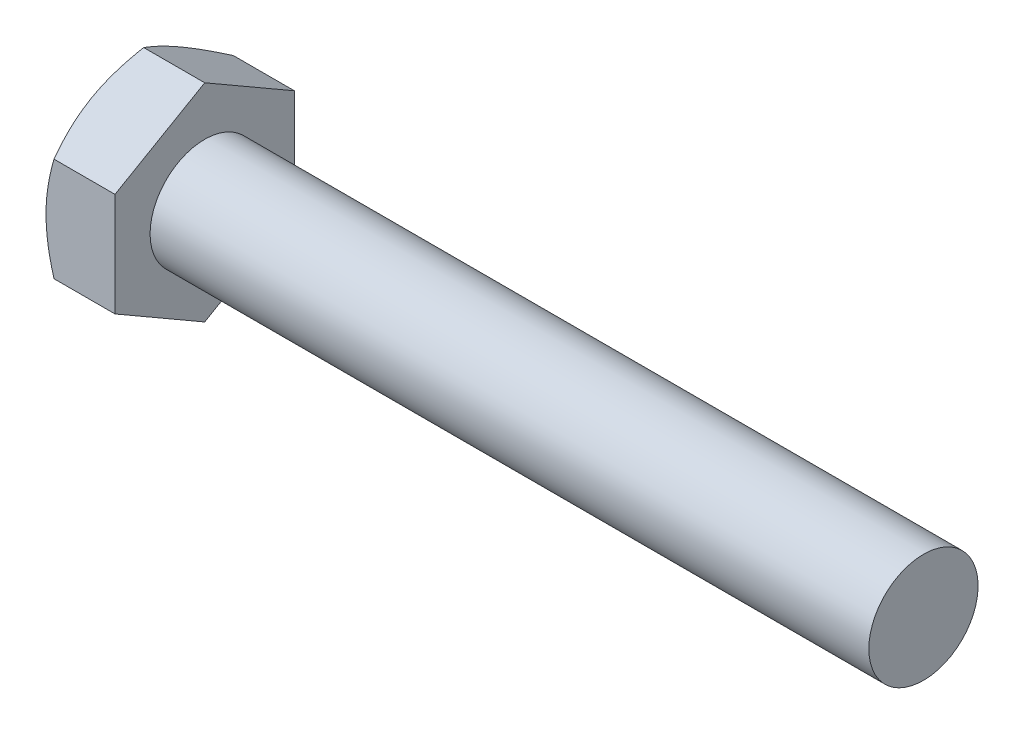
ISO-10303-21;
HEADER;
FILE_DESCRIPTION(('STEP AP214'),'2;1');
FILE_NAME('part.step','',(''),(''),'','','');
FILE_SCHEMA(('AUTOMOTIVE_DESIGN { 1 0 10303 214 1 1 1 1 }'));
ENDSEC;
DATA;
#1=APPLICATION_CONTEXT('core data for automotive mechanical design processes');
#2=APPLICATION_PROTOCOL_DEFINITION('international standard','automotive_design',2000,#1);
#3=PRODUCT_CONTEXT('',#1,'mechanical');
#4=PRODUCT('Part','Part','',(#3));
#5=PRODUCT_RELATED_PRODUCT_CATEGORY('part','',(#4));
#6=PRODUCT_DEFINITION_FORMATION('','',#4);
#7=PRODUCT_DEFINITION_CONTEXT('part definition',#1,'design');
#8=PRODUCT_DEFINITION('design','',#6,#7);
#9=PRODUCT_DEFINITION_SHAPE('','',#8);
#10=(LENGTH_UNIT() NAMED_UNIT(*) SI_UNIT(.MILLI.,.METRE.));
#11=(NAMED_UNIT(*) PLANE_ANGLE_UNIT() SI_UNIT($,.RADIAN.));
#12=(NAMED_UNIT(*) SI_UNIT($,.STERADIAN.) SOLID_ANGLE_UNIT());
#13=UNCERTAINTY_MEASURE_WITH_UNIT(LENGTH_MEASURE(1.E-05),#10,'distance_accuracy_value','');
#14=(GEOMETRIC_REPRESENTATION_CONTEXT(3) GLOBAL_UNCERTAINTY_ASSIGNED_CONTEXT((#13)) GLOBAL_UNIT_ASSIGNED_CONTEXT((#10,
#11,#12)) REPRESENTATION_CONTEXT('',''));
#15=CARTESIAN_POINT('',(0.,0.,0.));
#16=DIRECTION('',(0.,0.,1.));
#17=DIRECTION('',(1.,0.,0.));
#18=AXIS2_PLACEMENT_3D('',#15,#16,#17);
#19=CARTESIAN_POINT('',(3.048,2.413,0.));
#20=DIRECTION('',(-1.,0.,0.));
#21=DIRECTION('',(0.,0.,1.));
#22=AXIS2_PLACEMENT_3D('',#19,#20,#21);
#23=PLANE('',#22);
#24=CARTESIAN_POINT('',(3.048,0.,0.));
#25=DIRECTION('',(-1.,0.,0.));
#26=DIRECTION('',(0.,0.,1.));
#27=AXIS2_PLACEMENT_3D('',#24,#25,#26);
#28=CIRCLE('',#27,2.413);
#29=CARTESIAN_POINT('',(3.048,0.,2.413));
#30=VERTEX_POINT('',#29);
#31=EDGE_CURVE('E192',#30,#30,#28,.T.);
#32=ORIENTED_EDGE('',*,*,#31,.T.);
#33=EDGE_LOOP('',(#32));
#34=FACE_BOUND('',#33,.T.);
#35=DIRECTION('',(0.,1.,0.));
#36=VECTOR('',#35,1.);
#37=CARTESIAN_POINT('',(3.048,-2.28769271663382,3.9624));
#38=LINE('',#37,#36);
#39=CARTESIAN_POINT('',(3.048,-2.28769271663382,3.9624));
#40=VERTEX_POINT('',#39);
#41=CARTESIAN_POINT('',(3.048,2.28769271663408,3.9624));
#42=VERTEX_POINT('',#41);
#43=EDGE_CURVE('E56',#40,#42,#38,.T.);
#44=ORIENTED_EDGE('',*,*,#43,.F.);
#45=DIRECTION('',(0.,0.50000000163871,0.866025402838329));
#46=VECTOR('',#45,1.);
#47=CARTESIAN_POINT('',(3.048,-4.57538543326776,0.));
#48=LINE('',#47,#46);
#49=CARTESIAN_POINT('',(3.048,-4.57538543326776,0.));
#50=VERTEX_POINT('',#49);
#51=EDGE_CURVE('E129',#50,#40,#48,.T.);
#52=ORIENTED_EDGE('',*,*,#51,.F.);
#53=DIRECTION('',(0.,-0.50000000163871,0.866025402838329));
#54=VECTOR('',#53,1.);
#55=CARTESIAN_POINT('',(3.048,-2.28769271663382,-3.9624));
#56=LINE('',#55,#54);
#57=CARTESIAN_POINT('',(3.048,-2.28769271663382,-3.9624));
#58=VERTEX_POINT('',#57);
#59=EDGE_CURVE('E127',#58,#50,#56,.T.);
#60=ORIENTED_EDGE('',*,*,#59,.F.);
#61=DIRECTION('',(0.,-1.,0.));
#62=VECTOR('',#61,1.);
#63=CARTESIAN_POINT('',(3.048,2.28769271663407,-3.9624));
#64=LINE('',#63,#62);
#65=CARTESIAN_POINT('',(3.048,2.28769271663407,-3.9624));
#66=VERTEX_POINT('',#65);
#67=EDGE_CURVE('E110',#66,#58,#64,.T.);
#68=ORIENTED_EDGE('',*,*,#67,.F.);
#69=DIRECTION('',(0.,-0.50000000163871,-0.866025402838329));
#70=VECTOR('',#69,1.);
#71=CARTESIAN_POINT('',(3.048,4.57538543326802,0.));
#72=LINE('',#71,#70);
#73=CARTESIAN_POINT('',(3.048,4.57538543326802,0.));
#74=VERTEX_POINT('',#73);
#75=EDGE_CURVE('E119',#74,#66,#72,.T.);
#76=ORIENTED_EDGE('',*,*,#75,.F.);
#77=DIRECTION('',(0.,0.50000000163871,-0.866025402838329));
#78=VECTOR('',#77,1.);
#79=CARTESIAN_POINT('',(3.048,2.28769271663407,3.9624));
#80=LINE('',#79,#78);
#81=EDGE_CURVE('E123',#42,#74,#80,.T.);
#82=ORIENTED_EDGE('',*,*,#81,.F.);
#83=EDGE_LOOP('',(#44,#52,#60,#68,#76,#82));
#84=FACE_BOUND('',#83,.T.);
#85=ADVANCED_FACE('F33',(#34,#84),#23,.F.);
#86=CARTESIAN_POINT('',(-25.4,0.,0.));
#87=DIRECTION('',(-1.,0.,0.));
#88=DIRECTION('',(0.,0.,1.));
#89=AXIS2_PLACEMENT_3D('',#86,#87,#88);
#90=CYLINDRICAL_SURFACE('',#89,2.413);
#91=CARTESIAN_POINT('',(34.798,0.,0.));
#92=DIRECTION('',(-1.,0.,0.));
#93=DIRECTION('',(0.,0.,1.));
#94=AXIS2_PLACEMENT_3D('',#91,#92,#93);
#95=CIRCLE('',#94,2.413);
#96=CARTESIAN_POINT('',(34.798,0.,2.413));
#97=VERTEX_POINT('',#96);
#98=EDGE_CURVE('E11',#97,#97,#95,.T.);
#99=ORIENTED_EDGE('',*,*,#98,.T.);
#100=EDGE_LOOP('',(#99));
#101=FACE_BOUND('',#100,.T.);
#102=ORIENTED_EDGE('',*,*,#31,.F.);
#103=EDGE_LOOP('',(#102));
#104=FACE_BOUND('',#103,.T.);
#105=ADVANCED_FACE('F35',(#101,#104),#90,.T.);
#106=CARTESIAN_POINT('',(34.798,2.413,0.));
#107=DIRECTION('',(1.,0.,0.));
#108=DIRECTION('',(0.,0.,-1.));
#109=AXIS2_PLACEMENT_3D('',#106,#107,#108);
#110=PLANE('',#109);
#111=ORIENTED_EDGE('',*,*,#98,.F.);
#112=EDGE_LOOP('',(#111));
#113=FACE_BOUND('',#112,.T.);
#114=ADVANCED_FACE('F175',(#113),#110,.T.);
#115=CARTESIAN_POINT('',(3.048,-2.28769271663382,3.9624));
#116=DIRECTION('',(0.,0.,1.));
#117=DIRECTION('',(0.,-1.,0.));
#118=AXIS2_PLACEMENT_3D('',#115,#116,#117);
#119=PLANE('',#118);
#120=DIRECTION('',(-1.,0.,0.));
#121=VECTOR('',#120,1.);
#122=CARTESIAN_POINT('',(3.048,-2.28769271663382,3.9624));
#123=LINE('',#122,#121);
#124=CARTESIAN_POINT('',(0.353907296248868,-2.28769271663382,3.9624));
#125=VERTEX_POINT('',#124);
#126=EDGE_CURVE('E136',#40,#125,#123,.T.);
#127=ORIENTED_EDGE('',*,*,#126,.F.);
#128=ORIENTED_EDGE('',*,*,#43,.T.);
#129=DIRECTION('',(-1.,0.,0.));
#130=VECTOR('',#129,1.);
#131=CARTESIAN_POINT('',(3.048,2.28769271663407,3.9624));
#132=LINE('',#131,#130);
#133=CARTESIAN_POINT('',(0.353907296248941,2.28769271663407,3.9624));
#134=VERTEX_POINT('',#133);
#135=EDGE_CURVE('E135',#42,#134,#132,.T.);
#136=ORIENTED_EDGE('',*,*,#135,.T.);
#137=CARTESIAN_POINT('',(1.89611941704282,-6.06730895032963,3.9624));
#138=CARTESIAN_POINT('',(1.81204656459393,-5.89333709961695,3.9624));
#139=CARTESIAN_POINT('',(1.72880946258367,-5.71895392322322,3.9624));
#140=CARTESIAN_POINT('',(1.56448433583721,-5.36914251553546,3.9624));
#141=CARTESIAN_POINT('',(1.48339668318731,-5.19371410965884,3.9624));
#142=CARTESIAN_POINT('',(1.32342085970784,-4.8406421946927,3.9624));
#143=CARTESIAN_POINT('',(1.24454793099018,-4.66299175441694,3.9624));
#144=CARTESIAN_POINT('',(1.09018984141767,-4.30623074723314,3.9624));
#145=CARTESIAN_POINT('',(1.01470450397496,-4.12712025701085,3.9624));
#146=CARTESIAN_POINT('',(0.867126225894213,-3.76493071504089,3.9624));
#147=CARTESIAN_POINT('',(0.795086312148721,-3.58182993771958,3.9624));
#148=CARTESIAN_POINT('',(0.656648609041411,-3.21346869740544,3.9624));
#149=CARTESIAN_POINT('',(0.590251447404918,-3.02820799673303,3.9624));
#150=CARTESIAN_POINT('',(0.464883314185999,-2.65561267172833,3.9624));
#151=CARTESIAN_POINT('',(0.405896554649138,-2.46828341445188,3.9624));
#152=CARTESIAN_POINT('',(0.297264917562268,-2.09096176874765,3.9624));
#153=CARTESIAN_POINT('',(0.247617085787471,-1.90097024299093,3.9624));
#154=CARTESIAN_POINT('',(0.160073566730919,-1.51819430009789,3.9624));
#155=CARTESIAN_POINT('',(0.122181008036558,-1.32540915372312,3.9624));
#156=CARTESIAN_POINT('',(0.060699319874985,-0.937514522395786,3.9624));
#157=CARTESIAN_POINT('',(0.0371102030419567,-0.742405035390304,3.9624));
#158=CARTESIAN_POINT('',(0.00632221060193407,-0.352118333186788,3.9624));
#159=CARTESIAN_POINT('',(-0.000980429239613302,-0.156949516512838,3.9624));
#160=CARTESIAN_POINT('',(0.00119250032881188,0.233251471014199,3.9624));
#161=CARTESIAN_POINT('',(0.0106637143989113,0.428283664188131,3.9624));
#162=CARTESIAN_POINT('',(0.0404937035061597,0.761329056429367,3.9624));
#163=CARTESIAN_POINT('',(0.0569677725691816,0.89970968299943,3.9624));
#164=CARTESIAN_POINT('',(0.097288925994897,1.17540199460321,3.9624));
#165=CARTESIAN_POINT('',(0.121137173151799,1.31271350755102,3.9624));
#166=CARTESIAN_POINT('',(0.202491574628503,1.72293243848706,3.9624));
#167=CARTESIAN_POINT('',(0.269786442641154,1.99391703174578,3.9624));
#168=CARTESIAN_POINT('',(0.385851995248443,2.39940428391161,3.9624));
#169=CARTESIAN_POINT('',(0.427652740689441,2.53602054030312,3.9624));
#170=CARTESIAN_POINT('',(0.515390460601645,2.80782714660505,3.9624));
#171=CARTESIAN_POINT('',(0.561324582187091,2.94301840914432,3.9624));
#172=CARTESIAN_POINT('',(0.656373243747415,3.21140970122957,3.9624));
#173=CARTESIAN_POINT('',(0.705468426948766,3.34461665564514,3.9624));
#174=CARTESIAN_POINT('',(0.806540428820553,3.60999705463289,3.9624));
#175=CARTESIAN_POINT('',(0.858518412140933,3.74217005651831,3.9624));
#176=CARTESIAN_POINT('',(0.911653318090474,3.87386514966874,3.9624));
#177=B_SPLINE_CURVE_WITH_KNOTS('',3,(#137,#138,#139,#140,#141,#142,#143,#144,#145,#146,#147,
#148,#149,#150,#151,#152,#153,#154,#155,#156,#157,#158,#159,#160,#161,#162,#163,#164,#165,#166,
#167,#168,#169,#170,#171,#172,#173,#174,#175,#176),.UNSPECIFIED.,.F.,.F.,(4,2,2,2,2,2,2,2,2,2,2,
2,2,2,2,2,2,2,2,4),(0.,0.579671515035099,1.15944272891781,1.74253172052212,2.3255902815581,
2.91580715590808,3.50608960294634,4.09509231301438,4.683908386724,5.27288103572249,
5.86185420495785,6.44706406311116,7.03212199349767,7.44999130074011,7.86792653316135,
8.70441900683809,9.13298939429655,9.56126621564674,9.98713241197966,10.4131719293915),.UNSPECIFIED.);
#178=CARTESIAN_POINT('',(0.,0.,3.9624));
#179=VERTEX_POINT('',#178);
#180=EDGE_CURVE('E177',#179,#134,#177,.T.);
#181=ORIENTED_EDGE('',*,*,#180,.F.);
#182=EDGE_CURVE('E184',#125,#179,#177,.T.);
#183=ORIENTED_EDGE('',*,*,#182,.F.);
#184=EDGE_LOOP('',(#127,#128,#136,#181,#183));
#185=FACE_BOUND('',#184,.T.);
#186=ADVANCED_FACE('F171',(#185),#119,.T.);
#187=CARTESIAN_POINT('',(3.048,-4.57538543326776,0.));
#188=DIRECTION('',(0.,-0.866025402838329,0.50000000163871));
#189=DIRECTION('',(0.,-0.50000000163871,-0.866025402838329));
#190=AXIS2_PLACEMENT_3D('',#187,#188,#189);
#191=PLANE('',#190);
#192=DIRECTION('',(-1.,0.,0.));
#193=VECTOR('',#192,1.);
#194=CARTESIAN_POINT('',(3.048,-4.57538543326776,0.));
#195=LINE('',#194,#193);
#196=CARTESIAN_POINT('',(0.353907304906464,-4.57538543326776,0.));
#197=VERTEX_POINT('',#196);
#198=EDGE_CURVE('E140',#50,#197,#195,.T.);
#199=ORIENTED_EDGE('',*,*,#198,.F.);
#200=ORIENTED_EDGE('',*,*,#51,.T.);
#201=ORIENTED_EDGE('',*,*,#126,.T.);
#202=CARTESIAN_POINT('',(0.353973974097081,-4.57550090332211,-0.000200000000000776));
#203=CARTESIAN_POINT('',(0.295910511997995,-4.47496871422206,0.173926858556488));
#204=CARTESIAN_POINT('',(0.243103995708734,-4.37356873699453,0.349556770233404));
#205=CARTESIAN_POINT('',(0.15092988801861,-4.16901295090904,0.70385778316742));
#206=CARTESIAN_POINT('',(0.111594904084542,-4.06585350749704,0.882535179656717));
#207=CARTESIAN_POINT('',(0.0503645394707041,-3.86081308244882,1.23767561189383));
#208=CARTESIAN_POINT('',(0.0280616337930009,-3.75896364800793,1.41408400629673));
#209=CARTESIAN_POINT('',(0.00143705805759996,-3.55478556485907,1.76773081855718));
#210=CARTESIAN_POINT('',(-0.00290665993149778,-3.45245765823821,1.94496795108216));
#211=CARTESIAN_POINT('',(0.00613181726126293,-3.26125372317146,2.27614287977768));
#212=CARTESIAN_POINT('',(0.0172947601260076,-3.17234906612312,2.43013026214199));
#213=CARTESIAN_POINT('',(0.0526741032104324,-2.9951189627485,2.73710180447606));
#214=CARTESIAN_POINT('',(0.0769025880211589,-2.90679412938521,2.89008490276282));
#215=CARTESIAN_POINT('',(0.137471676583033,-2.72919863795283,3.19768931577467));
#216=CARTESIAN_POINT('',(0.174069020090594,-2.63995045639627,3.35227170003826));
#217=CARTESIAN_POINT('',(0.257130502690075,-2.46278517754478,3.65913096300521));
#218=CARTESIAN_POINT('',(0.303575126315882,-2.37486581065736,3.81141177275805));
#219=CARTESIAN_POINT('',(0.353973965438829,-2.28757724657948,3.9626));
#220=B_SPLINE_CURVE_WITH_KNOTS('',3,(#202,#203,#204,#205,#206,#207,#208,#209,#210,#211,#212,
#213,#214,#215,#216,#217,#218,#219),.UNSPECIFIED.,.F.,.F.,(4,2,2,2,2,2,2,2,4),(0.,
0.628087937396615,1.2576855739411,1.87170107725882,2.48496254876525,3.01893255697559,
3.55339729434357,4.09971705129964,4.64496405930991),.UNSPECIFIED.);
#221=CARTESIAN_POINT('',(0.,-3.43153906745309,1.98120001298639));
#222=VERTEX_POINT('',#221);
#223=EDGE_CURVE('E186',#222,#125,#220,.T.);
#224=ORIENTED_EDGE('',*,*,#223,.F.);
#225=EDGE_CURVE('E185',#197,#222,#220,.T.);
#226=ORIENTED_EDGE('',*,*,#225,.F.);
#227=EDGE_LOOP('',(#199,#200,#201,#224,#226));
#228=FACE_BOUND('',#227,.T.);
#229=ADVANCED_FACE('F174',(#228),#191,.T.);
#230=CARTESIAN_POINT('',(3.048,-2.28769271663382,-3.9624));
#231=DIRECTION('',(0.,-0.866025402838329,-0.50000000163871));
#232=DIRECTION('',(0.,0.50000000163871,-0.866025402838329));
#233=AXIS2_PLACEMENT_3D('',#230,#231,#232);
#234=PLANE('',#233);
#235=DIRECTION('',(-1.,0.,0.));
#236=VECTOR('',#235,1.);
#237=CARTESIAN_POINT('',(3.048,-2.28769271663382,-3.9624));
#238=LINE('',#237,#236);
#239=CARTESIAN_POINT('',(0.353907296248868,-2.28769271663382,-3.9624));
#240=VERTEX_POINT('',#239);
#241=EDGE_CURVE('E116',#58,#240,#238,.T.);
#242=ORIENTED_EDGE('',*,*,#241,.F.);
#243=ORIENTED_EDGE('',*,*,#59,.T.);
#244=ORIENTED_EDGE('',*,*,#198,.T.);
#245=CARTESIAN_POINT('',(0.35397396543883,-2.28757724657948,-3.9626));
#246=CARTESIAN_POINT('',(0.295910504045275,-2.3881094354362,-3.78847314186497));
#247=CARTESIAN_POINT('',(0.243103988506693,-2.48950941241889,-3.61284323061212));
#248=CARTESIAN_POINT('',(0.150929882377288,-2.69406519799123,-3.25854221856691));
#249=CARTESIAN_POINT('',(0.111594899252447,-2.79722464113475,-3.07986482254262));
#250=CARTESIAN_POINT('',(0.05036453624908,-3.00226506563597,-2.72472439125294));
#251=CARTESIAN_POINT('',(0.0280616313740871,-3.10411449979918,-2.54831599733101));
#252=CARTESIAN_POINT('',(0.0014370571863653,-3.30829258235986,-2.19466918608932));
#253=CARTESIAN_POINT('',(-0.00290666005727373,-3.41062048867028,-2.01743205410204));
#254=CARTESIAN_POINT('',(0.00613181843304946,-3.60182442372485,-1.68625712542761));
#255=CARTESIAN_POINT('',(0.0172947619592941,-3.69072908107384,-1.53226974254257));
#256=CARTESIAN_POINT('',(0.0526741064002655,-3.86795918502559,-1.22529819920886));
#257=CARTESIAN_POINT('',(0.0769025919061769,-3.95628401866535,-1.07231510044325));
#258=CARTESIAN_POINT('',(0.137471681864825,-4.13387951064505,-0.76471068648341));
#259=CARTESIAN_POINT('',(0.174069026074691,-4.22312769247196,-0.61012830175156));
#260=CARTESIAN_POINT('',(0.257130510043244,-4.40029297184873,-0.303269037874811));
#261=CARTESIAN_POINT('',(0.303575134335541,-4.48821233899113,-0.150988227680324));
#262=CARTESIAN_POINT('',(0.353973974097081,-4.57550090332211,0.000199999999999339));
#263=B_SPLINE_CURVE_WITH_KNOTS('',3,(#245,#246,#247,#248,#249,#250,#251,#252,#253,#254,#255,
#256,#257,#258,#259,#260,#261,#262),.UNSPECIFIED.,.F.,.F.,(4,2,2,2,2,2,2,2,4),(0.,
0.62808793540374,1.25768556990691,1.87170107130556,2.48496254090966,3.01893255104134,
3.55339729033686,4.09971704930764,4.64496405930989),.UNSPECIFIED.);
#264=CARTESIAN_POINT('',(0.,-3.43153906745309,-1.98120001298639));
#265=VERTEX_POINT('',#264);
#266=EDGE_CURVE('E215',#265,#197,#263,.T.);
#267=ORIENTED_EDGE('',*,*,#266,.F.);
#268=EDGE_CURVE('E220',#240,#265,#263,.T.);
#269=ORIENTED_EDGE('',*,*,#268,.F.);
#270=EDGE_LOOP('',(#242,#243,#244,#267,#269));
#271=FACE_BOUND('',#270,.T.);
#272=ADVANCED_FACE('F289',(#271),#234,.T.);
#273=CARTESIAN_POINT('',(3.048,2.28769271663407,-3.9624));
#274=DIRECTION('',(0.,0.,-1.));
#275=DIRECTION('',(-1.,0.,0.));
#276=AXIS2_PLACEMENT_3D('',#273,#274,#275);
#277=PLANE('',#276);
#278=DIRECTION('',(-1.,0.,0.));
#279=VECTOR('',#278,1.);
#280=CARTESIAN_POINT('',(3.048,2.28769271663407,-3.9624));
#281=LINE('',#280,#279);
#282=CARTESIAN_POINT('',(0.353907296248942,2.28769271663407,-3.9624));
#283=VERTEX_POINT('',#282);
#284=EDGE_CURVE('E105',#66,#283,#281,.T.);
#285=ORIENTED_EDGE('',*,*,#284,.F.);
#286=ORIENTED_EDGE('',*,*,#67,.T.);
#287=ORIENTED_EDGE('',*,*,#241,.T.);
#288=CARTESIAN_POINT('',(1.89611941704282,-6.06730895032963,-3.9624));
#289=CARTESIAN_POINT('',(1.81204656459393,-5.89333709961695,-3.9624));
#290=CARTESIAN_POINT('',(1.72880946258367,-5.71895392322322,-3.9624));
#291=CARTESIAN_POINT('',(1.56448433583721,-5.36914251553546,-3.9624));
#292=CARTESIAN_POINT('',(1.48339668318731,-5.19371410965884,-3.9624));
#293=CARTESIAN_POINT('',(1.32342085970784,-4.8406421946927,-3.9624));
#294=CARTESIAN_POINT('',(1.24454793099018,-4.66299175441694,-3.9624));
#295=CARTESIAN_POINT('',(1.09018984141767,-4.30623074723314,-3.9624));
#296=CARTESIAN_POINT('',(1.01470450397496,-4.12712025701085,-3.9624));
#297=CARTESIAN_POINT('',(0.867126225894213,-3.76493071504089,-3.9624));
#298=CARTESIAN_POINT('',(0.795086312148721,-3.58182993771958,-3.9624));
#299=CARTESIAN_POINT('',(0.65664860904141,-3.21346869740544,-3.9624));
#300=CARTESIAN_POINT('',(0.590251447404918,-3.02820799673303,-3.9624));
#301=CARTESIAN_POINT('',(0.464883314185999,-2.65561267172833,-3.9624));
#302=CARTESIAN_POINT('',(0.405896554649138,-2.46828341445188,-3.9624));
#303=CARTESIAN_POINT('',(0.297264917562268,-2.09096176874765,-3.9624));
#304=CARTESIAN_POINT('',(0.247617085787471,-1.90097024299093,-3.9624));
#305=CARTESIAN_POINT('',(0.160073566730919,-1.51819430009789,-3.9624));
#306=CARTESIAN_POINT('',(0.122181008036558,-1.32540915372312,-3.9624));
#307=CARTESIAN_POINT('',(0.0606993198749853,-0.937514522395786,-3.9624));
#308=CARTESIAN_POINT('',(0.037110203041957,-0.742405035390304,-3.9624));
#309=CARTESIAN_POINT('',(0.00632221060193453,-0.352118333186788,-3.9624));
#310=CARTESIAN_POINT('',(-0.000980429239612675,-0.156949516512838,-3.9624));
#311=CARTESIAN_POINT('',(0.00119250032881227,0.233251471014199,-3.9624));
#312=CARTESIAN_POINT('',(0.0106637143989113,0.428283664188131,-3.9624));
#313=CARTESIAN_POINT('',(0.0404937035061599,0.761329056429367,-3.9624));
#314=CARTESIAN_POINT('',(0.0569677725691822,0.899709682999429,-3.9624));
#315=CARTESIAN_POINT('',(0.0972889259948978,1.17540199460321,-3.9624));
#316=CARTESIAN_POINT('',(0.121137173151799,1.31271350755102,-3.9624));
#317=CARTESIAN_POINT('',(0.202491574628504,1.72293243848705,-3.9624));
#318=CARTESIAN_POINT('',(0.269786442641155,1.99391703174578,-3.9624));
#319=CARTESIAN_POINT('',(0.385851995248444,2.39940428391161,-3.9624));
#320=CARTESIAN_POINT('',(0.427652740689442,2.53602054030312,-3.9624));
#321=CARTESIAN_POINT('',(0.515390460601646,2.80782714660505,-3.9624));
#322=CARTESIAN_POINT('',(0.561324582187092,2.94301840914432,-3.9624));
#323=CARTESIAN_POINT('',(0.656373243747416,3.21140970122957,-3.9624));
#324=CARTESIAN_POINT('',(0.705468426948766,3.34461665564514,-3.9624));
#325=CARTESIAN_POINT('',(0.806540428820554,3.60999705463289,-3.9624));
#326=CARTESIAN_POINT('',(0.858518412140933,3.74217005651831,-3.9624));
#327=CARTESIAN_POINT('',(0.911653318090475,3.87386514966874,-3.9624));
#328=B_SPLINE_CURVE_WITH_KNOTS('',3,(#288,#289,#290,#291,#292,#293,#294,#295,#296,#297,#298,
#299,#300,#301,#302,#303,#304,#305,#306,#307,#308,#309,#310,#311,#312,#313,#314,#315,#316,#317,
#318,#319,#320,#321,#322,#323,#324,#325,#326,#327),.UNSPECIFIED.,.F.,.F.,(4,2,2,2,2,2,2,2,2,2,2,
2,2,2,2,2,2,2,2,4),(0.,0.579671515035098,1.15944272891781,1.74253172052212,2.3255902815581,
2.91580715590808,3.50608960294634,4.09509231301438,4.683908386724,5.27288103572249,
5.86185420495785,6.44706406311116,7.03212199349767,7.44999130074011,7.86792653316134,
8.70441900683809,9.13298939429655,9.56126621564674,9.98713241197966,10.4131719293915),.UNSPECIFIED.);
#329=CARTESIAN_POINT('',(0.,0.,-3.9624));
#330=VERTEX_POINT('',#329);
#331=EDGE_CURVE('E216',#330,#240,#328,.F.);
#332=ORIENTED_EDGE('',*,*,#331,.F.);
#333=EDGE_CURVE('E113',#283,#330,#328,.F.);
#334=ORIENTED_EDGE('',*,*,#333,.F.);
#335=EDGE_LOOP('',(#285,#286,#287,#332,#334));
#336=FACE_BOUND('',#335,.T.);
#337=ADVANCED_FACE('F107',(#336),#277,.T.);
#338=CARTESIAN_POINT('',(3.048,4.57538543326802,0.));
#339=DIRECTION('',(0.,0.866025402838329,-0.50000000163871));
#340=DIRECTION('',(0.,0.50000000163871,0.866025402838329));
#341=AXIS2_PLACEMENT_3D('',#338,#339,#340);
#342=PLANE('',#341);
#343=DIRECTION('',(-1.,0.,0.));
#344=VECTOR('',#343,1.);
#345=CARTESIAN_POINT('',(3.048,4.57538543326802,0.));
#346=LINE('',#345,#344);
#347=CARTESIAN_POINT('',(0.353907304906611,4.57538543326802,0.));
#348=VERTEX_POINT('',#347);
#349=EDGE_CURVE('E48',#74,#348,#346,.T.);
#350=ORIENTED_EDGE('',*,*,#349,.F.);
#351=ORIENTED_EDGE('',*,*,#75,.T.);
#352=ORIENTED_EDGE('',*,*,#284,.T.);
#353=CARTESIAN_POINT('',(0.353973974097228,4.57550090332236,0.000199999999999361));
#354=CARTESIAN_POINT('',(0.295910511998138,4.47496871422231,-0.173926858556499));
#355=CARTESIAN_POINT('',(0.243103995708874,4.37356873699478,-0.349556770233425));
#356=CARTESIAN_POINT('',(0.150929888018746,4.16901295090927,-0.703857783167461));
#357=CARTESIAN_POINT('',(0.111594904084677,4.06585350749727,-0.882535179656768));
#358=CARTESIAN_POINT('',(0.0503645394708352,3.86081308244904,-1.2376756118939));
#359=CARTESIAN_POINT('',(0.0280616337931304,3.75896364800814,-1.41408400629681));
#360=CARTESIAN_POINT('',(0.00143705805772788,3.55478556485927,-1.76773081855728));
#361=CARTESIAN_POINT('',(-0.00290665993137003,3.45245765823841,-1.94496795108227));
#362=CARTESIAN_POINT('',(0.00613181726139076,3.26125372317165,-2.27614287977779));
#363=CARTESIAN_POINT('',(0.0172947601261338,3.17234906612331,-2.43013026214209));
#364=CARTESIAN_POINT('',(0.0526741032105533,2.99511896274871,-2.73710180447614));
#365=CARTESIAN_POINT('',(0.0769025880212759,2.90679412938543,-2.89008490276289));
#366=CARTESIAN_POINT('',(0.137471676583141,2.72919863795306,-3.19768931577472));
#367=CARTESIAN_POINT('',(0.174069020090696,2.6399504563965,-3.3522717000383));
#368=CARTESIAN_POINT('',(0.257130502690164,2.46278517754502,-3.65913096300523));
#369=CARTESIAN_POINT('',(0.303575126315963,2.37486581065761,-3.81141177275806));
#370=CARTESIAN_POINT('',(0.353973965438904,2.28757724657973,-3.9626));
#371=B_SPLINE_CURVE_WITH_KNOTS('',3,(#353,#354,#355,#356,#357,#358,#359,#360,#361,#362,#363,
#364,#365,#366,#367,#368,#369,#370),.UNSPECIFIED.,.F.,.F.,(4,2,2,2,2,2,2,2,4),(0.,
0.62808793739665,1.25768557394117,1.87170107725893,2.48496254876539,3.0189325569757,
3.55339729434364,4.09971705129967,4.64496405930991),.UNSPECIFIED.);
#372=CARTESIAN_POINT('',(0.,3.43153906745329,-1.9812000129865));
#373=VERTEX_POINT('',#372);
#374=EDGE_CURVE('E154',#373,#283,#371,.T.);
#375=ORIENTED_EDGE('',*,*,#374,.F.);
#376=EDGE_CURVE('E279',#348,#373,#371,.T.);
#377=ORIENTED_EDGE('',*,*,#376,.F.);
#378=EDGE_LOOP('',(#350,#351,#352,#375,#377));
#379=FACE_BOUND('',#378,.T.);
#380=ADVANCED_FACE('F120',(#379),#342,.T.);
#381=CARTESIAN_POINT('',(3.048,2.28769271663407,3.9624));
#382=DIRECTION('',(0.,0.866025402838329,0.50000000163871));
#383=DIRECTION('',(0.,-0.50000000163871,0.866025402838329));
#384=AXIS2_PLACEMENT_3D('',#381,#382,#383);
#385=PLANE('',#384);
#386=ORIENTED_EDGE('',*,*,#135,.F.);
#387=ORIENTED_EDGE('',*,*,#81,.T.);
#388=ORIENTED_EDGE('',*,*,#349,.T.);
#389=CARTESIAN_POINT('',(0.353973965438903,2.28757724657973,3.9626));
#390=CARTESIAN_POINT('',(0.295910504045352,2.38810943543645,3.78847314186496));
#391=CARTESIAN_POINT('',(0.243103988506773,2.48950941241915,3.6128432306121));
#392=CARTESIAN_POINT('',(0.150929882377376,2.6940651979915,3.25854221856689));
#393=CARTESIAN_POINT('',(0.111594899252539,2.79722464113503,3.07986482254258));
#394=CARTESIAN_POINT('',(0.0503645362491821,3.00226506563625,2.7247243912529));
#395=CARTESIAN_POINT('',(0.0280616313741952,3.10411449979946,2.54831599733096));
#396=CARTESIAN_POINT('',(0.00143705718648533,3.30829258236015,2.19466918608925));
#397=CARTESIAN_POINT('',(-0.00290666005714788,3.41062048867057,2.01743205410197));
#398=CARTESIAN_POINT('',(0.00613181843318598,3.60182442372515,1.68625712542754));
#399=CARTESIAN_POINT('',(0.0172947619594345,3.69072908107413,1.53226974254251));
#400=CARTESIAN_POINT('',(0.0526741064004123,3.86795918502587,1.22529819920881));
#401=CARTESIAN_POINT('',(0.0769025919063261,3.95628401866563,1.0723151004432));
#402=CARTESIAN_POINT('',(0.137471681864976,4.13387951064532,0.764710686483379));
#403=CARTESIAN_POINT('',(0.174069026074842,4.22312769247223,0.610128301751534));
#404=CARTESIAN_POINT('',(0.257130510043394,4.40029297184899,0.303269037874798));
#405=CARTESIAN_POINT('',(0.303575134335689,4.48821233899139,0.150988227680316));
#406=CARTESIAN_POINT('',(0.353973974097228,4.57550090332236,-0.000200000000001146));
#407=B_SPLINE_CURVE_WITH_KNOTS('',3,(#389,#390,#391,#392,#393,#394,#395,#396,#397,#398,#399,
#400,#401,#402,#403,#404,#405,#406),.UNSPECIFIED.,.F.,.F.,(4,2,2,2,2,2,2,2,4),(0.,
0.628087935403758,1.25768556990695,1.87170107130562,2.48496254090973,3.0189325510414,
3.5533972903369,4.09971704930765,4.64496405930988),.UNSPECIFIED.);
#408=CARTESIAN_POINT('',(0.,3.43153906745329,1.9812000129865));
#409=VERTEX_POINT('',#408);
#410=EDGE_CURVE('E139',#409,#348,#407,.T.);
#411=ORIENTED_EDGE('',*,*,#410,.F.);
#412=EDGE_CURVE('E153',#134,#409,#407,.T.);
#413=ORIENTED_EDGE('',*,*,#412,.F.);
#414=EDGE_LOOP('',(#386,#387,#388,#411,#413));
#415=FACE_BOUND('',#414,.T.);
#416=ADVANCED_FACE('F164',(#415),#385,.T.);
#417=CARTESIAN_POINT('',(0.,0.,0.));
#418=DIRECTION('',(1.,0.,0.));
#419=DIRECTION('',(0.,0.,-1.));
#420=AXIS2_PLACEMENT_3D('',#417,#418,#419);
#421=CONICAL_SURFACE('',#420,3.9624,1.0471975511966);
#422=CARTESIAN_POINT('',(0.,0.,0.));
#423=DIRECTION('',(-1.,0.,0.));
#424=DIRECTION('',(0.,0.,1.));
#425=AXIS2_PLACEMENT_3D('',#422,#423,#424);
#426=CIRCLE('',#425,3.9624);
#427=EDGE_CURVE('E194',#222,#179,#426,.T.);
#428=ORIENTED_EDGE('',*,*,#427,.F.);
#429=ORIENTED_EDGE('',*,*,#223,.T.);
#430=ORIENTED_EDGE('',*,*,#182,.T.);
#431=EDGE_LOOP('',(#428,#429,#430));
#432=FACE_BOUND('',#431,.T.);
#433=ADVANCED_FACE('F168',(#432),#421,.T.);
#434=EDGE_CURVE('E202',#265,#222,#426,.T.);
#435=ORIENTED_EDGE('',*,*,#434,.F.);
#436=ORIENTED_EDGE('',*,*,#266,.T.);
#437=ORIENTED_EDGE('',*,*,#225,.T.);
#438=EDGE_LOOP('',(#435,#436,#437));
#439=FACE_BOUND('',#438,.T.);
#440=ADVANCED_FACE('F225',(#439),#421,.T.);
#441=ORIENTED_EDGE('',*,*,#331,.T.);
#442=ORIENTED_EDGE('',*,*,#268,.T.);
#443=EDGE_CURVE('E205',#330,#265,#426,.T.);
#444=ORIENTED_EDGE('',*,*,#443,.F.);
#445=EDGE_LOOP('',(#441,#442,#444));
#446=FACE_BOUND('',#445,.T.);
#447=ADVANCED_FACE('F160',(#446),#421,.T.);
#448=ORIENTED_EDGE('',*,*,#374,.T.);
#449=ORIENTED_EDGE('',*,*,#333,.T.);
#450=EDGE_CURVE('E201',#373,#330,#426,.T.);
#451=ORIENTED_EDGE('',*,*,#450,.F.);
#452=EDGE_LOOP('',(#448,#449,#451));
#453=FACE_BOUND('',#452,.T.);
#454=ADVANCED_FACE('F214',(#453),#421,.T.);
#455=EDGE_CURVE('E41',#179,#409,#426,.T.);
#456=ORIENTED_EDGE('',*,*,#455,.F.);
#457=ORIENTED_EDGE('',*,*,#180,.T.);
#458=ORIENTED_EDGE('',*,*,#412,.T.);
#459=EDGE_LOOP('',(#456,#457,#458));
#460=FACE_BOUND('',#459,.T.);
#461=ADVANCED_FACE('F253',(#460),#421,.T.);
#462=CARTESIAN_POINT('',(0.,0.,0.));
#463=DIRECTION('',(-1.,0.,0.));
#464=DIRECTION('',(0.,0.,1.));
#465=AXIS2_PLACEMENT_3D('',#462,#463,#464);
#466=PLANE('',#465);
#467=CARTESIAN_POINT('',(0.,0.,0.));
#468=DIRECTION('',(1.,0.,0.));
#469=DIRECTION('',(0.,0.,-1.));
#470=AXIS2_PLACEMENT_3D('',#467,#468,#469);
#471=CIRCLE('',#470,3.4671);
#472=CARTESIAN_POINT('',(0.,0.,3.4671));
#473=VERTEX_POINT('',#472);
#474=EDGE_CURVE('E233',#473,#473,#471,.T.);
#475=ORIENTED_EDGE('',*,*,#474,.T.);
#476=EDGE_LOOP('',(#475));
#477=FACE_BOUND('',#476,.T.);
#478=ORIENTED_EDGE('',*,*,#455,.T.);
#479=EDGE_CURVE('E196',#409,#373,#426,.T.);
#480=ORIENTED_EDGE('',*,*,#479,.T.);
#481=ORIENTED_EDGE('',*,*,#450,.T.);
#482=ORIENTED_EDGE('',*,*,#443,.T.);
#483=ORIENTED_EDGE('',*,*,#434,.T.);
#484=ORIENTED_EDGE('',*,*,#427,.T.);
#485=EDGE_LOOP('',(#478,#480,#481,#482,#483,#484));
#486=FACE_BOUND('',#485,.T.);
#487=ADVANCED_FACE('F211',(#477,#486),#466,.T.);
#488=ORIENTED_EDGE('',*,*,#410,.T.);
#489=ORIENTED_EDGE('',*,*,#376,.T.);
#490=ORIENTED_EDGE('',*,*,#479,.F.);
#491=EDGE_LOOP('',(#488,#489,#490));
#492=FACE_BOUND('',#491,.T.);
#493=ADVANCED_FACE('F243',(#492),#421,.T.);
#494=CARTESIAN_POINT('',(0.381,0.,0.));
#495=DIRECTION('',(-1.,0.,0.));
#496=DIRECTION('',(0.,0.,1.));
#497=AXIS2_PLACEMENT_3D('',#494,#495,#496);
#498=CYLINDRICAL_SURFACE('',#497,3.4671);
#499=CARTESIAN_POINT('',(0.381,0.,0.));
#500=DIRECTION('',(1.,0.,0.));
#501=DIRECTION('',(0.,0.,-1.));
#502=AXIS2_PLACEMENT_3D('',#499,#500,#501);
#503=CIRCLE('',#502,3.4671);
#504=CARTESIAN_POINT('',(0.381,0.,3.4671));
#505=VERTEX_POINT('',#504);
#506=EDGE_CURVE('E230',#505,#505,#503,.T.);
#507=CARTESIAN_POINT('',(0.381,0.,3.4671));
#508=CARTESIAN_POINT('',(0.37703125,0.,3.4671));
#509=CARTESIAN_POINT('',(0.3730625,0.,3.4671));
#510=CARTESIAN_POINT('',(0.365125,0.,3.4671));
#511=CARTESIAN_POINT('',(0.36115625,0.,3.4671));
#512=CARTESIAN_POINT('',(0.35321875,0.,3.4671));
#513=CARTESIAN_POINT('',(0.34925,0.,3.4671));
#514=CARTESIAN_POINT('',(0.3413125,0.,3.4671));
#515=CARTESIAN_POINT('',(0.33734375,0.,3.4671));
#516=CARTESIAN_POINT('',(0.32940625,0.,3.4671));
#517=CARTESIAN_POINT('',(0.3254375,0.,3.4671));
#518=CARTESIAN_POINT('',(0.3175,0.,3.4671));
#519=CARTESIAN_POINT('',(0.31353125,0.,3.4671));
#520=CARTESIAN_POINT('',(0.30559375,0.,3.4671));
#521=CARTESIAN_POINT('',(0.301625,0.,3.4671));
#522=CARTESIAN_POINT('',(0.2936875,0.,3.4671));
#523=CARTESIAN_POINT('',(0.28971875,0.,3.4671));
#524=CARTESIAN_POINT('',(0.28178125,0.,3.4671));
#525=CARTESIAN_POINT('',(0.2778125,0.,3.4671));
#526=CARTESIAN_POINT('',(0.269875,0.,3.4671));
#527=CARTESIAN_POINT('',(0.26590625,0.,3.4671));
#528=CARTESIAN_POINT('',(0.25796875,0.,3.4671));
#529=CARTESIAN_POINT('',(0.254,0.,3.4671));
#530=CARTESIAN_POINT('',(0.2460625,0.,3.4671));
#531=CARTESIAN_POINT('',(0.24209375,0.,3.4671));
#532=CARTESIAN_POINT('',(0.23415625,0.,3.4671));
#533=CARTESIAN_POINT('',(0.2301875,0.,3.4671));
#534=CARTESIAN_POINT('',(0.22225,0.,3.4671));
#535=CARTESIAN_POINT('',(0.21828125,0.,3.4671));
#536=CARTESIAN_POINT('',(0.21034375,0.,3.4671));
#537=CARTESIAN_POINT('',(0.206375,0.,3.4671));
#538=CARTESIAN_POINT('',(0.1984375,0.,3.4671));
#539=CARTESIAN_POINT('',(0.19446875,0.,3.4671));
#540=CARTESIAN_POINT('',(0.18653125,0.,3.4671));
#541=CARTESIAN_POINT('',(0.1825625,0.,3.4671));
#542=CARTESIAN_POINT('',(0.174625,0.,3.4671));
#543=CARTESIAN_POINT('',(0.17065625,0.,3.4671));
#544=CARTESIAN_POINT('',(0.16271875,0.,3.4671));
#545=CARTESIAN_POINT('',(0.15875,0.,3.4671));
#546=CARTESIAN_POINT('',(0.1508125,0.,3.4671));
#547=CARTESIAN_POINT('',(0.14684375,0.,3.4671));
#548=CARTESIAN_POINT('',(0.13890625,0.,3.4671));
#549=CARTESIAN_POINT('',(0.1349375,0.,3.4671));
#550=CARTESIAN_POINT('',(0.127,0.,3.4671));
#551=CARTESIAN_POINT('',(0.12303125,0.,3.4671));
#552=CARTESIAN_POINT('',(0.11509375,0.,3.4671));
#553=CARTESIAN_POINT('',(0.111125,0.,3.4671));
#554=CARTESIAN_POINT('',(0.1031875,0.,3.4671));
#555=CARTESIAN_POINT('',(0.09921875,0.,3.4671));
#556=CARTESIAN_POINT('',(0.09128125,0.,3.4671));
#557=CARTESIAN_POINT('',(0.0873125,0.,3.4671));
#558=CARTESIAN_POINT('',(0.079375,0.,3.4671));
#559=CARTESIAN_POINT('',(0.07540625,0.,3.4671));
#560=CARTESIAN_POINT('',(0.06746875,0.,3.4671));
#561=CARTESIAN_POINT('',(0.0635,0.,3.4671));
#562=CARTESIAN_POINT('',(0.0555625,0.,3.4671));
#563=CARTESIAN_POINT('',(0.05159375,0.,3.4671));
#564=CARTESIAN_POINT('',(0.04365625,0.,3.4671));
#565=CARTESIAN_POINT('',(0.0396875,0.,3.4671));
#566=CARTESIAN_POINT('',(0.03175,0.,3.4671));
#567=CARTESIAN_POINT('',(0.02778125,0.,3.4671));
#568=CARTESIAN_POINT('',(0.01984375,0.,3.4671));
#569=CARTESIAN_POINT('',(0.015875,0.,3.4671));
#570=CARTESIAN_POINT('',(0.00793749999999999,0.,3.4671));
#571=CARTESIAN_POINT('',(0.00396874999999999,0.,3.4671));
#572=CARTESIAN_POINT('',(0.,0.,3.4671));
#573=B_SPLINE_CURVE_WITH_KNOTS('',3,(#507,#508,#509,#510,#511,#512,#513,#514,#515,#516,#517,
#518,#519,#520,#521,#522,#523,#524,#525,#526,#527,#528,#529,#530,#531,#532,#533,#534,#535,#536,
#537,#538,#539,#540,#541,#542,#543,#544,#545,#546,#547,#548,#549,#550,#551,#552,#553,#554,#555,
#556,#557,#558,#559,#560,#561,#562,#563,#564,#565,#566,#567,#568,#569,#570,#571,#572),
.UNSPECIFIED.,.F.,.F.,(4,2,2,2,2,2,2,2,2,2,2,2,2,2,2,2,2,2,2,2,2,2,2,2,2,2,2,2,2,2,2,2,4),(0.,
0.01190625,0.0238125,0.03571875,0.047625,0.05953125,0.0714375,0.08334375,0.09525,0.10715625,
0.1190625,0.13096875,0.142875,0.15478125,0.1666875,0.17859375,0.1905,0.20240625,0.2143125,
0.22621875,0.238125,0.25003125,0.2619375,0.27384375,0.28575,0.29765625,0.3095625,0.32146875,
0.333375,0.34528125,0.3571875,0.36909375,0.381),.UNSPECIFIED.);
#574=EDGE_CURVE('BSEAM240',#505,#473,#573,.T.);
#575=ORIENTED_EDGE('',*,*,#506,.T.);
#576=ORIENTED_EDGE('',*,*,#474,.F.);
#577=ORIENTED_EDGE('',*,*,#574,.T.);
#578=ORIENTED_EDGE('',*,*,#574,.F.);
#579=EDGE_LOOP('',(#575,#577,#576,#578));
#580=FACE_BOUND('',#579,.T.);
#581=ADVANCED_FACE('F240',(#580),#498,.F.);
#582=CARTESIAN_POINT('',(0.381,0.,0.));
#583=DIRECTION('',(1.,0.,0.));
#584=DIRECTION('',(0.,0.,-1.));
#585=AXIS2_PLACEMENT_3D('',#582,#583,#584);
#586=PLANE('',#585);
#587=ORIENTED_EDGE('',*,*,#506,.F.);
#588=EDGE_LOOP('',(#587));
#589=FACE_BOUND('',#588,.T.);
#590=ADVANCED_FACE('F242',(#589),#586,.F.);
#591=CLOSED_SHELL('',(#85,#105,#114,#186,#229,#272,#337,#380,#416,#433,#440,#447,#454,#461,#487,
#493,#581,#590));
#592=MANIFOLD_SOLID_BREP('B2',#591);
#593=ADVANCED_BREP_SHAPE_REPRESENTATION('',(#18,#592),#14);
#594=SHAPE_DEFINITION_REPRESENTATION(#9,#593);
ENDSEC;
END-ISO-10303-21;
